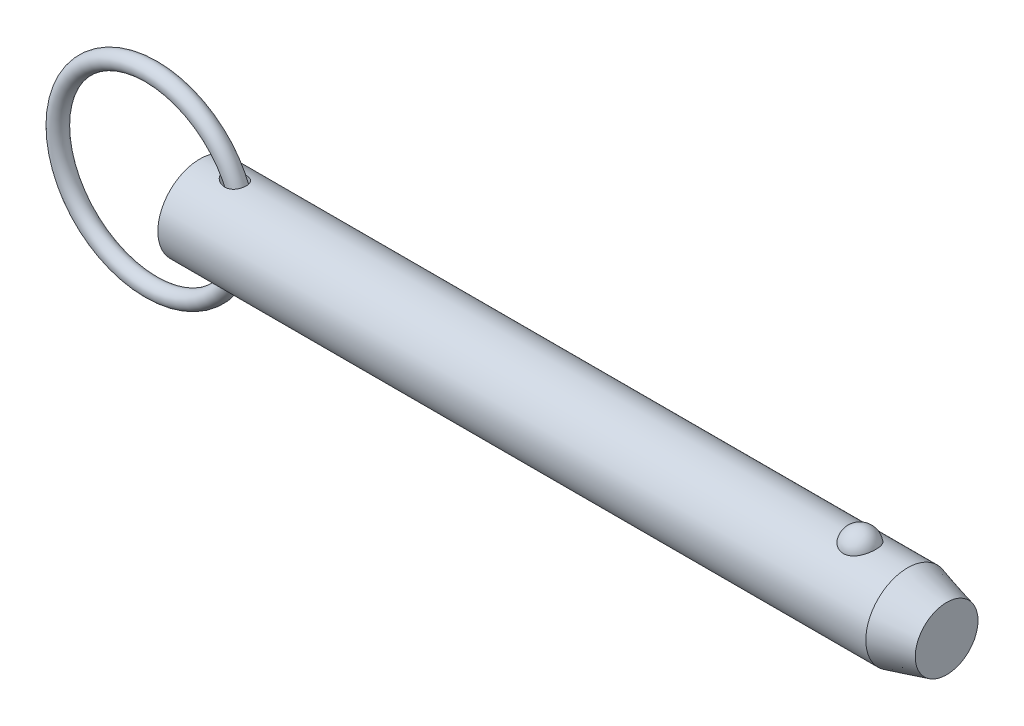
ISO-10303-21;
HEADER;
FILE_DESCRIPTION(('STEP AP214'),'2;1');
FILE_NAME('part.step','',(''),(''),'','','');
FILE_SCHEMA(('AUTOMOTIVE_DESIGN { 1 0 10303 214 1 1 1 1 }'));
ENDSEC;
DATA;
#1=APPLICATION_CONTEXT('core data for automotive mechanical design processes');
#2=APPLICATION_PROTOCOL_DEFINITION('international standard','automotive_design',2000,#1);
#3=PRODUCT_CONTEXT('',#1,'mechanical');
#4=PRODUCT('Part','Part','',(#3));
#5=PRODUCT_RELATED_PRODUCT_CATEGORY('part','',(#4));
#6=PRODUCT_DEFINITION_FORMATION('','',#4);
#7=PRODUCT_DEFINITION_CONTEXT('part definition',#1,'design');
#8=PRODUCT_DEFINITION('design','',#6,#7);
#9=PRODUCT_DEFINITION_SHAPE('','',#8);
#10=(LENGTH_UNIT() NAMED_UNIT(*) SI_UNIT(.MILLI.,.METRE.));
#11=(NAMED_UNIT(*) PLANE_ANGLE_UNIT() SI_UNIT($,.RADIAN.));
#12=(NAMED_UNIT(*) SI_UNIT($,.STERADIAN.) SOLID_ANGLE_UNIT());
#13=UNCERTAINTY_MEASURE_WITH_UNIT(LENGTH_MEASURE(1.E-05),#10,'distance_accuracy_value','');
#14=(GEOMETRIC_REPRESENTATION_CONTEXT(3) GLOBAL_UNCERTAINTY_ASSIGNED_CONTEXT((#13)) GLOBAL_UNIT_ASSIGNED_CONTEXT((#10,
#11,#12)) REPRESENTATION_CONTEXT('',''));
#15=CARTESIAN_POINT('',(0.,0.,0.));
#16=DIRECTION('',(0.,0.,1.));
#17=DIRECTION('',(1.,0.,0.));
#18=AXIS2_PLACEMENT_3D('',#15,#16,#17);
#19=CARTESIAN_POINT('',(-8.23730968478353,0.,0.));
#20=DIRECTION('',(0.,0.,1.));
#21=DIRECTION('',(1.,0.,0.));
#22=AXIS2_PLACEMENT_3D('',#19,#20,#21);
#23=TOROIDAL_SURFACE('',#22,15.875,1.422);
#24=CARTESIAN_POINT('',(9.05969031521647,0.,0.));
#25=VERTEX_POINT('',#24);
#26=VERTEX_LOOP('',#25);
#27=FACE_BOUND('',#26,.T.);
#28=ADVANCED_FACE('P0_F12',(#27),#23,.T.);
#29=CLOSED_SHELL('',(#28));
#30=MANIFOLD_SOLID_BREP('P0_B1',#29);
#31=CARTESIAN_POINT('',(0.,0.,0.));
#32=DIRECTION('',(1.,0.,0.));
#33=DIRECTION('',(0.,0.,-1.));
#34=AXIS2_PLACEMENT_3D('',#31,#32,#33);
#35=CYLINDRICAL_SURFACE('',#34,7.11);
#36=CARTESIAN_POINT('',(3.98467340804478,7.10072679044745,-0.363013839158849));
#37=CARTESIAN_POINT('',(4.00971652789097,7.09600153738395,-0.45539194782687));
#38=CARTESIAN_POINT('',(4.04401947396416,7.08958406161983,-0.545230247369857));
#39=CARTESIAN_POINT('',(4.12810160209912,7.07427055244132,-0.717157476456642));
#40=CARTESIAN_POINT('',(4.17791765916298,7.06536861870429,-0.799227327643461));
#41=CARTESIAN_POINT('',(4.28924471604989,7.04620300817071,-0.953469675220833));
#42=CARTESIAN_POINT('',(4.35063580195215,7.035953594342,-1.02573162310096));
#43=CARTESIAN_POINT('',(4.48282610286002,7.01493313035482,-1.16081412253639));
#44=CARTESIAN_POINT('',(4.55362244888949,7.00416223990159,-1.22363754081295));
#45=CARTESIAN_POINT('',(4.71659336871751,6.98090398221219,-1.35055080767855));
#46=CARTESIAN_POINT('',(4.81029272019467,6.96847103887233,-1.41269256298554));
#47=CARTESIAN_POINT('',(5.0057240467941,6.94515366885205,-1.52319699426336));
#48=CARTESIAN_POINT('',(5.10746392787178,6.93427079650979,-1.57154588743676));
#49=CARTESIAN_POINT('',(5.33503739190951,6.91346066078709,-1.66091325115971));
#50=CARTESIAN_POINT('',(5.46199550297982,6.90402388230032,-1.69921932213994));
#51=CARTESIAN_POINT('',(5.72084799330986,6.89024030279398,-1.75428261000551));
#52=CARTESIAN_POINT('',(5.85274301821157,6.88589416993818,-1.77103699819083));
#53=CARTESIAN_POINT('',(6.11557710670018,6.88337277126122,-1.78081990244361));
#54=CARTESIAN_POINT('',(6.24650031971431,6.88510489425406,-1.77420448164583));
#55=CARTESIAN_POINT('',(6.50446311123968,6.89478744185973,-1.73620392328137));
#56=CARTESIAN_POINT('',(6.6315075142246,6.90272978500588,-1.70485097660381));
#57=CARTESIAN_POINT('',(6.85933269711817,6.92243075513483,-1.62281888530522));
#58=CARTESIAN_POINT('',(6.96133251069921,6.93352131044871,-1.5753580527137));
#59=CARTESIAN_POINT('',(7.15436649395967,6.95824811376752,-1.46226310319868));
#60=CARTESIAN_POINT('',(7.24540699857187,6.97188287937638,-1.3966395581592));
#61=CARTESIAN_POINT('',(7.40446019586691,6.99838217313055,-1.25668991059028));
#62=CARTESIAN_POINT('',(7.473875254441,7.01118308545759,-1.18393777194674));
#63=CARTESIAN_POINT('',(7.59904891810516,7.03582803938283,-1.02736918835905));
#64=CARTESIAN_POINT('',(7.65481029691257,7.04767227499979,-0.943554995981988));
#65=CARTESIAN_POINT('',(7.74982438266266,7.06873077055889,-0.76979592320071));
#66=CARTESIAN_POINT('',(7.7894903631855,7.07800861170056,-0.680084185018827));
#67=CARTESIAN_POINT('',(7.85354088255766,7.09334756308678,-0.495102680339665));
#68=CARTESIAN_POINT('',(7.87792559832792,7.09940871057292,-0.399832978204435));
#69=CARTESIAN_POINT('',(7.9108898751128,7.10766731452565,-0.206294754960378));
#70=CARTESIAN_POINT('',(7.91944662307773,7.10985919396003,-0.108022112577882));
#71=CARTESIAN_POINT('',(7.920501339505,7.11012756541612,0.0886168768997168));
#72=CARTESIAN_POINT('',(7.91299895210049,7.10820396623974,0.186983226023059));
#73=CARTESIAN_POINT('',(7.88205794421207,7.10043733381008,0.381270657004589));
#74=CARTESIAN_POINT('',(7.85857985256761,7.09458459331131,0.477185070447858));
#75=CARTESIAN_POINT('',(7.79617406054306,7.07958431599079,0.663575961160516));
#76=CARTESIAN_POINT('',(7.75724672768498,7.07043685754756,0.754052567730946));
#77=CARTESIAN_POINT('',(7.66496731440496,7.04987259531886,0.926798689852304));
#78=CARTESIAN_POINT('',(7.61164530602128,7.0384605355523,1.00908483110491));
#79=CARTESIAN_POINT('',(7.49191707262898,7.01461776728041,1.16333092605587));
#80=CARTESIAN_POINT('',(7.42551210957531,7.00218715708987,1.235291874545));
#81=CARTESIAN_POINT('',(7.28164031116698,6.97770944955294,1.36680167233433));
#82=CARTESIAN_POINT('',(7.20420170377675,6.96566146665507,1.42638126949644));
#83=CARTESIAN_POINT('',(7.0403906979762,6.94319963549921,1.53199377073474));
#84=CARTESIAN_POINT('',(6.95401827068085,6.93278579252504,1.57802663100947));
#85=CARTESIAN_POINT('',(6.7731858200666,6.91444459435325,1.65656940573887));
#86=CARTESIAN_POINT('',(6.67860569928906,6.90656682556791,1.68881327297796));
#87=CARTESIAN_POINT('',(6.48544119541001,6.89422806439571,1.73849768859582));
#88=CARTESIAN_POINT('',(6.38685561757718,6.88976809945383,1.755933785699));
#89=CARTESIAN_POINT('',(6.18089829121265,6.88429907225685,1.77726234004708));
#90=CARTESIAN_POINT('',(6.07340937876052,6.88356485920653,1.78007646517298));
#91=CARTESIAN_POINT('',(5.85921220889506,6.886086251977,1.77029087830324));
#92=CARTESIAN_POINT('',(5.75250426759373,6.88934339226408,1.75768523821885));
#93=CARTESIAN_POINT('',(5.52848027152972,6.89994454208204,1.71563399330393));
#94=CARTESIAN_POINT('',(5.41155168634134,6.90775772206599,1.68424184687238));
#95=CARTESIAN_POINT('',(5.18376466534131,6.92670168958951,1.60454711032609));
#96=CARTESIAN_POINT('',(5.07291446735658,6.9378368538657,1.5562221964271));
#97=CARTESIAN_POINT('',(4.84835244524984,6.96347168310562,1.43744827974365));
#98=CARTESIAN_POINT('',(4.73562531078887,6.97820486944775,1.36517310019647));
#99=CARTESIAN_POINT('',(4.52504912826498,7.00822340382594,1.20158053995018));
#100=CARTESIAN_POINT('',(4.42717478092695,7.02350775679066,1.11029618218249));
#101=CARTESIAN_POINT('',(4.27935716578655,7.04784659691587,0.940654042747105));
#102=CARTESIAN_POINT('',(4.2239722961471,7.05736064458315,0.867099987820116));
#103=CARTESIAN_POINT('',(4.12558347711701,7.07469854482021,0.711919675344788));
#104=CARTESIAN_POINT('',(4.08256922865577,7.0825238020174,0.630300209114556));
#105=CARTESIAN_POINT('',(4.01142860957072,7.09565978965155,0.459428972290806));
#106=CARTESIAN_POINT('',(3.98346043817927,7.10094374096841,0.370107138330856));
#107=CARTESIAN_POINT('',(3.95517285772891,7.1063173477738,0.233358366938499));
#108=CARTESIAN_POINT('',(3.94802115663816,7.1076831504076,0.187321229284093));
#109=CARTESIAN_POINT('',(3.93842121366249,7.10951900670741,0.0947476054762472));
#110=CARTESIAN_POINT('',(3.93597129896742,7.10998937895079,0.0482113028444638));
#111=CARTESIAN_POINT('',(3.93584361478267,7.11001358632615,-0.0598597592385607));
#112=CARTESIAN_POINT('',(3.9399538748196,7.10922402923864,-0.121405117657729));
#113=CARTESIAN_POINT('',(3.95632793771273,7.10609781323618,-0.243320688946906));
#114=CARTESIAN_POINT('',(3.96859135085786,7.10376122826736,-0.303690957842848));
#115=CARTESIAN_POINT('',(3.98467340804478,7.10072679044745,-0.363013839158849));
#116=B_SPLINE_CURVE_WITH_KNOTS('',3,(#36,#37,#38,#39,#40,#41,#42,#43,#44,#45,#46,#47,#48,#49,
#50,#51,#52,#53,#54,#55,#56,#57,#58,#59,#60,#61,#62,#63,#64,#65,#66,#67,#68,#69,#70,#71,#72,#73,
#74,#75,#76,#77,#78,#79,#80,#81,#82,#83,#84,#85,#86,#87,#88,#89,#90,#91,#92,#93,#94,#95,#96,#97,
#98,#99,#100,#101,#102,#103,#104,#105,#106,#107,#108,#109,#110,#111,#112,#113,#114,#115),
.UNSPECIFIED.,.T.,.F.,(4,2,2,2,2,2,2,2,2,2,2,2,2,2,2,2,2,2,2,2,2,2,2,2,2,2,2,2,2,2,2,2,2,2,2,2,
2,2,2,4),(0.,0.287206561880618,0.575101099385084,0.860162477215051,1.14513709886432,
1.48324846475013,1.82169652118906,2.21865672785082,2.6156690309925,3.00665870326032,
3.39714041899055,3.73437585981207,4.07141541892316,4.37402271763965,4.67656849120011,
4.97076150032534,5.26495110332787,5.55956439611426,5.85418421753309,6.14953461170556,
6.44487798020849,6.73960905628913,7.03431171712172,7.32827352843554,7.6222362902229,
7.9216396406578,8.22113296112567,8.54242840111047,8.86384740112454,9.22635035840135,
9.58933304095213,9.99153142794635,10.3930368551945,10.6697219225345,10.9461759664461,
11.2254825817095,11.3650959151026,11.5046595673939,11.6891051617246,11.8735419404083),.UNSPECIFIED.);
#117=CARTESIAN_POINT('',(3.98467340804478,7.10072679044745,-0.363013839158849));
#118=VERTEX_POINT('',#117);
#119=EDGE_CURVE('P1_E40',#118,#118,#116,.T.);
#120=ORIENTED_EDGE('',*,*,#119,.T.);
#121=EDGE_LOOP('',(#120));
#122=FACE_BOUND('',#121,.T.);
#123=CARTESIAN_POINT('',(120.336279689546,0.,0.));
#124=DIRECTION('',(1.,0.,0.));
#125=DIRECTION('',(0.,0.,-1.));
#126=AXIS2_PLACEMENT_3D('',#123,#124,#125);
#127=CIRCLE('',#126,7.11);
#128=CARTESIAN_POINT('',(120.336279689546,0.,-7.11));
#129=VERTEX_POINT('',#128);
#130=EDGE_CURVE('P1_E25',#129,#129,#127,.T.);
#131=ORIENTED_EDGE('',*,*,#130,.F.);
#132=EDGE_LOOP('',(#131));
#133=FACE_BOUND('',#132,.T.);
#134=CARTESIAN_POINT('',(0.,0.,0.));
#135=DIRECTION('',(1.,0.,0.));
#136=DIRECTION('',(0.,0.,-1.));
#137=AXIS2_PLACEMENT_3D('',#134,#135,#136);
#138=CIRCLE('',#137,7.11);
#139=CARTESIAN_POINT('',(0.,0.,-7.11));
#140=VERTEX_POINT('',#139);
#141=EDGE_CURVE('P1_E9',#140,#140,#138,.T.);
#142=ORIENTED_EDGE('',*,*,#141,.T.);
#143=EDGE_LOOP('',(#142));
#144=FACE_BOUND('',#143,.T.);
#145=CARTESIAN_POINT('',(112.229258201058,6.53646663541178,2.79762469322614));
#146=CARTESIAN_POINT('',(112.084429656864,6.53647876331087,2.79761243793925));
#147=CARTESIAN_POINT('',(111.939368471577,6.54144531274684,2.78608115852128));
#148=CARTESIAN_POINT('',(111.653292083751,6.56077791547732,2.74023282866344));
#149=CARTESIAN_POINT('',(111.512288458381,6.57516852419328,2.70585624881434));
#150=CARTESIAN_POINT('',(111.23888335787,6.61165072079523,2.6154404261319));
#151=CARTESIAN_POINT('',(111.106460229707,6.63372195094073,2.55945840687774));
#152=CARTESIAN_POINT('',(110.853233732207,6.68316012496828,2.42742958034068));
#153=CARTESIAN_POINT('',(110.732425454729,6.71052481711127,2.35139129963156));
#154=CARTESIAN_POINT('',(110.501637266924,6.76860821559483,2.17866150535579));
#155=CARTESIAN_POINT('',(110.392085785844,6.79940242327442,2.08142342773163));
#156=CARTESIAN_POINT('',(110.19033404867,6.86050242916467,1.87020907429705));
#157=CARTESIAN_POINT('',(110.098139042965,6.89080807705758,1.75622775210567));
#158=CARTESIAN_POINT('',(109.92925478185,6.94923069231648,1.50900646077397));
#159=CARTESIAN_POINT('',(109.853428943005,6.97719213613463,1.37513873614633));
#160=CARTESIAN_POINT('',(109.724206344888,7.02647251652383,1.09584817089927));
#161=CARTESIAN_POINT('',(109.670810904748,7.04779106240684,0.950424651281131));
#162=CARTESIAN_POINT('',(109.587101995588,7.08180248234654,0.650508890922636));
#163=CARTESIAN_POINT('',(109.557025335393,7.09440672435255,0.495940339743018));
#164=CARTESIAN_POINT('',(109.521473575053,7.10935121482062,0.183515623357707));
#165=CARTESIAN_POINT('',(109.515997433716,7.11169189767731,0.0256595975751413));
#166=CARTESIAN_POINT('',(109.529700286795,7.10589702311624,-0.287512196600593));
#167=CARTESIAN_POINT('',(109.54868231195,7.0978451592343,-0.442838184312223));
#168=CARTESIAN_POINT('',(109.61057450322,7.07221860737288,-0.747830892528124));
#169=CARTESIAN_POINT('',(109.653485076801,7.05464375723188,-0.897497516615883));
#170=CARTESIAN_POINT('',(109.762452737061,7.01171031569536,-1.18722864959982));
#171=CARTESIAN_POINT('',(109.828545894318,6.98633960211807,-1.32727778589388));
#172=CARTESIAN_POINT('',(109.982536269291,6.93042258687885,-1.59370324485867));
#173=CARTESIAN_POINT('',(110.070435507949,6.89987580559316,-1.72007829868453));
#174=CARTESIAN_POINT('',(110.266926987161,6.83659510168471,-1.95657345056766));
#175=CARTESIAN_POINT('',(110.375664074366,6.80384697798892,-2.06656957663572));
#176=CARTESIAN_POINT('',(110.610968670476,6.74001831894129,-2.26611005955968));
#177=CARTESIAN_POINT('',(110.737535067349,6.7089376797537,-2.3556556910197));
#178=CARTESIAN_POINT('',(111.002845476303,6.65264442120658,-2.51019726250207));
#179=CARTESIAN_POINT('',(111.141323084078,6.62733449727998,-2.57561395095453));
#180=CARTESIAN_POINT('',(111.428519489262,6.58495995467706,-2.68211134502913));
#181=CARTESIAN_POINT('',(111.577234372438,6.56789220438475,-2.72320129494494));
#182=CARTESIAN_POINT('',(111.872626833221,6.54478663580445,-2.77825810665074));
#183=CARTESIAN_POINT('',(112.01902951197,6.53823639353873,-2.79348727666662));
#184=CARTESIAN_POINT('',(112.312470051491,6.5353271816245,-2.80028921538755));
#185=CARTESIAN_POINT('',(112.459507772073,6.53896606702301,-2.79186696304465));
#186=CARTESIAN_POINT('',(112.744921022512,6.55570357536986,-2.75232178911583));
#187=CARTESIAN_POINT('',(112.883422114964,6.56848455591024,-2.72196077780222));
#188=CARTESIAN_POINT('',(113.153114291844,6.60173528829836,-2.64028774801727));
#189=CARTESIAN_POINT('',(113.284304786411,6.62220565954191,-2.58897404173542));
#190=CARTESIAN_POINT('',(113.538846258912,6.66917927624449,-2.46547820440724));
#191=CARTESIAN_POINT('',(113.661969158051,6.69580233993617,-2.39287266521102));
#192=CARTESIAN_POINT('',(113.894441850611,6.75207041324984,-2.22915269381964));
#193=CARTESIAN_POINT('',(114.003788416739,6.78171612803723,-2.13803393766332));
#194=CARTESIAN_POINT('',(114.211642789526,6.8426462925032,-1.93445592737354));
#195=CARTESIAN_POINT('',(114.309317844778,6.87393748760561,-1.8211477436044));
#196=CARTESIAN_POINT('',(114.485011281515,6.93345710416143,-1.57947787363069));
#197=CARTESIAN_POINT('',(114.563026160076,6.96168497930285,-1.45111351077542));
#198=CARTESIAN_POINT('',(114.699985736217,7.01307558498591,-1.17842708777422));
#199=CARTESIAN_POINT('',(114.758258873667,7.03605262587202,-1.03373189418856));
#200=CARTESIAN_POINT('',(114.851081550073,7.07340932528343,-0.735867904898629));
#201=CARTESIAN_POINT('',(114.885631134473,7.08778900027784,-0.582699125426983));
#202=CARTESIAN_POINT('',(114.930274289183,7.10647639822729,-0.272420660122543));
#203=CARTESIAN_POINT('',(114.94039710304,7.11079616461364,-0.115315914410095));
#204=CARTESIAN_POINT('',(114.936061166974,7.10896059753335,0.198488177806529));
#205=CARTESIAN_POINT('',(114.921603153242,7.10280557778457,0.355187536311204));
#206=CARTESIAN_POINT('',(114.868572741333,7.08071500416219,0.662724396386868));
#207=CARTESIAN_POINT('',(114.83015058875,7.06484039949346,0.813592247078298));
#208=CARTESIAN_POINT('',(114.730101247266,7.0249589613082,1.10629159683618));
#209=CARTESIAN_POINT('',(114.668472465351,7.00095156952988,1.24812247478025));
#210=CARTESIAN_POINT('',(114.522766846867,6.94706632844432,1.51976439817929));
#211=CARTESIAN_POINT('',(114.438544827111,6.91715085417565,1.64949012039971));
#212=CARTESIAN_POINT('',(114.249586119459,6.85470565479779,1.8923128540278));
#213=CARTESIAN_POINT('',(114.144850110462,6.82217601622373,2.00541041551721));
#214=CARTESIAN_POINT('',(113.917103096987,6.75805358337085,2.21190674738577));
#215=CARTESIAN_POINT('',(113.794082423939,6.72646129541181,2.30529503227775));
#216=CARTESIAN_POINT('',(113.53273470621,6.66789520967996,2.46959908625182));
#217=CARTESIAN_POINT('',(113.394401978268,6.64092313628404,2.54050647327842));
#218=CARTESIAN_POINT('',(113.111182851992,6.59572583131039,2.6556004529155));
#219=CARTESIAN_POINT('',(112.966666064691,6.57724013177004,2.70059539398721));
#220=CARTESIAN_POINT('',(112.671546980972,6.55006426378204,2.76587321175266));
#221=CARTESIAN_POINT('',(112.520964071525,6.54134511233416,2.78622922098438));
#222=CARTESIAN_POINT('',(112.323046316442,6.53697847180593,2.79642434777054));
#223=CARTESIAN_POINT('',(112.276164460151,6.53646270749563,2.79762866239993));
#224=CARTESIAN_POINT('',(112.229258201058,6.53646663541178,2.79762469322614));
#225=B_SPLINE_CURVE_WITH_KNOTS('',3,(#145,#146,#147,#148,#149,#150,#151,#152,#153,#154,#155,
#156,#157,#158,#159,#160,#161,#162,#163,#164,#165,#166,#167,#168,#169,#170,#171,#172,#173,#174,
#175,#176,#177,#178,#179,#180,#181,#182,#183,#184,#185,#186,#187,#188,#189,#190,#191,#192,#193,
#194,#195,#196,#197,#198,#199,#200,#201,#202,#203,#204,#205,#206,#207,#208,#209,#210,#211,#212,
#213,#214,#215,#216,#217,#218,#219,#220,#221,#222,#223,#224),.UNSPECIFIED.,.T.,.F.,(4,2,2,2,2,2,
2,2,2,2,2,2,2,2,2,2,2,2,2,2,2,2,2,2,2,2,2,2,2,2,2,2,2,2,2,2,2,2,2,4),(0.,0.434355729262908,
0.869847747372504,1.30419416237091,1.738356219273,2.18541922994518,2.63261726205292,
3.0995426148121,3.56649542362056,4.0381303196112,4.50974525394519,4.97758575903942,
5.44543423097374,5.91401389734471,6.38263700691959,6.85464418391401,7.32662193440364,
7.78992971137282,8.25306131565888,8.69285754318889,9.13256119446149,9.55768625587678,
9.98284556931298,10.4171106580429,10.851477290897,11.3079089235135,11.7644218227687,
12.2351898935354,12.7059570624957,13.1761603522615,13.6463495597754,14.1136200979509,
14.5809227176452,15.0513032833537,15.5216682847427,15.9922828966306,16.4630727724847,
16.9182457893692,17.3720644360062,17.5127411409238),.UNSPECIFIED.);
#226=CARTESIAN_POINT('',(112.229258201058,6.53646663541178,2.79762469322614));
#227=VERTEX_POINT('',#226);
#228=EDGE_CURVE('P1_E34',#227,#227,#225,.T.);
#229=ORIENTED_EDGE('',*,*,#228,.T.);
#230=EDGE_LOOP('',(#229));
#231=FACE_BOUND('',#230,.T.);
#232=CARTESIAN_POINT('',(3.98467340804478,-7.10072679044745,-0.363013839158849));
#233=CARTESIAN_POINT('',(3.96426456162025,-7.10457733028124,-0.287714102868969));
#234=CARTESIAN_POINT('',(3.95000501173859,-7.10730349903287,-0.210695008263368));
#235=CARTESIAN_POINT('',(3.93481801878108,-7.11020840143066,-0.0553038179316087));
#236=CARTESIAN_POINT('',(3.93388435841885,-7.11038832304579,0.0230676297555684));
#237=CARTESIAN_POINT('',(3.94541910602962,-7.10817995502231,0.178714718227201));
#238=CARTESIAN_POINT('',(3.95787987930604,-7.10579312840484,0.25599095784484));
#239=CARTESIAN_POINT('',(3.99523775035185,-7.09872642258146,0.407352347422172));
#240=CARTESIAN_POINT('',(4.02014065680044,-7.09404547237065,0.481435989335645));
#241=CARTESIAN_POINT('',(4.08119600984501,-7.08278363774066,0.625775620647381));
#242=CARTESIAN_POINT('',(4.11749458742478,-7.07617815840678,0.695967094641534));
#243=CARTESIAN_POINT('',(4.19940836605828,-7.06165305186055,0.830508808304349));
#244=CARTESIAN_POINT('',(4.24502952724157,-7.0537325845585,0.894855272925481));
#245=CARTESIAN_POINT('',(4.36790232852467,-7.03310314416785,1.04688574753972));
#246=CARTESIAN_POINT('',(4.44977459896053,-7.01993229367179,1.13078695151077));
#247=CARTESIAN_POINT('',(4.62610796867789,-6.99351259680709,1.28411726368));
#248=CARTESIAN_POINT('',(4.7205898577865,-6.98026365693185,1.35352197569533));
#249=CARTESIAN_POINT('',(4.92036507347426,-6.9549104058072,1.47831921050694));
#250=CARTESIAN_POINT('',(5.02579054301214,-6.94282458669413,1.53350332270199));
#251=CARTESIAN_POINT('',(5.24378330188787,-6.92129098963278,1.62793610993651));
#252=CARTESIAN_POINT('',(5.35635066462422,-6.91184323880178,1.66718462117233));
#253=CARTESIAN_POINT('',(5.60134354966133,-6.89573491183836,1.73269893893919));
#254=CARTESIAN_POINT('',(5.73444697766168,-6.8895970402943,1.75661057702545));
#255=CARTESIAN_POINT('',(6.00300738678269,-6.88344616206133,1.78057487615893));
#256=CARTESIAN_POINT('',(6.13846360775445,-6.88343121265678,1.78063510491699));
#257=CARTESIAN_POINT('',(6.39660470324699,-6.88981379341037,1.75576480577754));
#258=CARTESIAN_POINT('',(6.51947843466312,-6.89572457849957,1.73273121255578));
#259=CARTESIAN_POINT('',(6.75813770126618,-6.91274434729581,1.66352936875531));
#260=CARTESIAN_POINT('',(6.87393155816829,-6.92384709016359,1.61738888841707));
#261=CARTESIAN_POINT('',(7.07801861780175,-6.94787316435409,1.51052664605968));
#262=CARTESIAN_POINT('',(7.16789841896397,-6.96033024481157,1.45271574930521));
#263=CARTESIAN_POINT('',(7.33546773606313,-6.98638661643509,1.32171912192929));
#264=CARTESIAN_POINT('',(7.41316182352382,-6.99998547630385,1.24853918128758));
#265=CARTESIAN_POINT('',(7.54861420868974,-7.02559503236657,1.09486170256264));
#266=CARTESIAN_POINT('',(7.60741145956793,-7.03764930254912,1.01528346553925));
#267=CARTESIAN_POINT('',(7.71070740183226,-7.0598657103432,0.847099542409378));
#268=CARTESIAN_POINT('',(7.75520788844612,-7.0700280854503,0.758494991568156));
#269=CARTESIAN_POINT('',(7.82836147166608,-7.08722075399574,0.575936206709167));
#270=CARTESIAN_POINT('',(7.85719783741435,-7.09428707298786,0.482058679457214));
#271=CARTESIAN_POINT('',(7.89918378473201,-7.10470260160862,0.29065874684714));
#272=CARTESIAN_POINT('',(7.91233308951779,-7.10805174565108,0.193136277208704));
#273=CARTESIAN_POINT('',(7.92267451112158,-7.11067890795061,-0.00313968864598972));
#274=CARTESIAN_POINT('',(7.91981203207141,-7.10994299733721,-0.10189624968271));
#275=CARTESIAN_POINT('',(7.89806489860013,-7.10444651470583,-0.297516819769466));
#276=CARTESIAN_POINT('',(7.87918005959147,-7.09968589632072,-0.394380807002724));
#277=CARTESIAN_POINT('',(7.82577988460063,-7.0866471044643,-0.58355375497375));
#278=CARTESIAN_POINT('',(7.79124976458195,-7.07836560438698,-0.675858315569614));
#279=CARTESIAN_POINT('',(7.70736343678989,-7.05919003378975,-0.853167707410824));
#280=CARTESIAN_POINT('',(7.65800801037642,-7.04829610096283,-0.938172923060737));
#281=CARTESIAN_POINT('',(7.54590141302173,-7.02513961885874,-1.09819812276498));
#282=CARTESIAN_POINT('',(7.48319521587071,-7.01288172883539,-1.17325029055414));
#283=CARTESIAN_POINT('',(7.34599775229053,-6.98832192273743,-1.31164333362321));
#284=CARTESIAN_POINT('',(7.27150757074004,-6.97602001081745,-1.37498528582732));
#285=CARTESIAN_POINT('',(7.11277776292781,-6.95268608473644,-1.48849974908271));
#286=CARTESIAN_POINT('',(7.02852525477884,-6.94165578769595,-1.53865456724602));
#287=CARTESIAN_POINT('',(6.85282430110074,-6.92200320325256,-1.62478650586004));
#288=CARTESIAN_POINT('',(6.76137511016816,-6.91338116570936,-1.66076215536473));
#289=CARTESIAN_POINT('',(6.57061179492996,-6.89906044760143,-1.71930563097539));
#290=CARTESIAN_POINT('',(6.47113516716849,-6.89347290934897,-1.74136795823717));
#291=CARTESIAN_POINT('',(6.26989833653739,-6.88605020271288,-1.7704895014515));
#292=CARTESIAN_POINT('',(6.16813737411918,-6.88421630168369,-1.77754365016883));
#293=CARTESIAN_POINT('',(5.95492537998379,-6.88424071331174,-1.77745174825));
#294=CARTESIAN_POINT('',(5.8434768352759,-6.88646827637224,-1.76888555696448));
#295=CARTESIAN_POINT('',(5.62307560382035,-6.89483827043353,-1.73596677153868));
#296=CARTESIAN_POINT('',(5.51412477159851,-6.90098351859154,-1.71160281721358));
#297=CARTESIAN_POINT('',(5.28644478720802,-6.91743803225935,-1.64393691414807));
#298=CARTESIAN_POINT('',(5.16837217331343,-6.92819628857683,-1.59852806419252));
#299=CARTESIAN_POINT('',(4.94091825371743,-6.95234836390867,-1.4899796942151));
#300=CARTESIAN_POINT('',(4.83153887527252,-6.96574276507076,-1.42683625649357));
#301=CARTESIAN_POINT('',(4.63576710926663,-6.99209234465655,-1.29112257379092));
#302=CARTESIAN_POINT('',(4.54816728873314,-7.00494184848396,-1.22027748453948));
#303=CARTESIAN_POINT('',(4.38554897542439,-7.03019055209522,-1.0652111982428));
#304=CARTESIAN_POINT('',(4.31052141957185,-7.04259007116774,-0.980999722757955));
#305=CARTESIAN_POINT('',(4.18551811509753,-7.0640229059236,-0.811206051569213));
#306=CARTESIAN_POINT('',(4.13358417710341,-7.07328321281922,-0.727107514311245));
#307=CARTESIAN_POINT('',(4.04607461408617,-7.0891994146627,-0.550580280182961));
#308=CARTESIAN_POINT('',(4.01046401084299,-7.09586087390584,-0.458169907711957));
#309=CARTESIAN_POINT('',(3.98467340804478,-7.10072679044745,-0.363013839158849));
#310=B_SPLINE_CURVE_WITH_KNOTS('',3,(#232,#233,#234,#235,#236,#237,#238,#239,#240,#241,#242,
#243,#244,#245,#246,#247,#248,#249,#250,#251,#252,#253,#254,#255,#256,#257,#258,#259,#260,#261,
#262,#263,#264,#265,#266,#267,#268,#269,#270,#271,#272,#273,#274,#275,#276,#277,#278,#279,#280,
#281,#282,#283,#284,#285,#286,#287,#288,#289,#290,#291,#292,#293,#294,#295,#296,#297,#298,#299,
#300,#301,#302,#303,#304,#305,#306,#307,#308,#309),.UNSPECIFIED.,.T.,.F.,(4,2,2,2,2,2,2,2,2,2,2,
2,2,2,2,2,2,2,2,2,2,2,2,2,2,2,2,2,2,2,2,2,2,2,2,2,2,2,4),(0.,0.23402065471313,0.467932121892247,
0.701710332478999,0.935597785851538,1.17261620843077,1.40978663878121,1.76177576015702,
2.11435255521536,2.47183528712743,2.8293216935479,3.23332937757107,3.63720887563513,
4.01042610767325,4.38319587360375,4.70425151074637,5.02518641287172,5.32277979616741,
5.62033579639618,5.91433101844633,6.2083314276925,6.50333490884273,6.79834178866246,
7.09362801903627,7.38889868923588,7.6831900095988,7.9774542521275,8.27211131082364,
8.56679892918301,8.8716552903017,9.17661456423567,9.51069129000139,9.84500851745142,
10.2243046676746,10.6036846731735,10.9425776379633,11.2812252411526,11.5775945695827,
11.8733258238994),.UNSPECIFIED.);
#311=CARTESIAN_POINT('',(3.98467340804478,-7.10072679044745,-0.363013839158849));
#312=VERTEX_POINT('',#311);
#313=EDGE_CURVE('P1_E17',#312,#312,#310,.T.);
#314=ORIENTED_EDGE('',*,*,#313,.T.);
#315=EDGE_LOOP('',(#314));
#316=FACE_BOUND('',#315,.T.);
#317=ADVANCED_FACE('P1_F13',(#122,#133,#144,#231,#316),#35,.T.);
#318=CARTESIAN_POINT('',(0.,0.,0.));
#319=DIRECTION('',(-1.,0.,0.));
#320=DIRECTION('',(0.,0.,1.));
#321=AXIS2_PLACEMENT_3D('',#318,#319,#320);
#322=PLANE('',#321);
#323=ORIENTED_EDGE('',*,*,#141,.F.);
#324=EDGE_LOOP('',(#323));
#325=FACE_BOUND('',#324,.T.);
#326=ADVANCED_FACE('P1_F15',(#325),#322,.T.);
#327=CARTESIAN_POINT('',(126.97,0.,0.));
#328=DIRECTION('',(-1.,0.,0.));
#329=DIRECTION('',(0.,0.,1.));
#330=AXIS2_PLACEMENT_3D('',#327,#328,#329);
#331=CONICAL_SURFACE('',#330,5.33250000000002,0.26179938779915);
#332=ORIENTED_EDGE('',*,*,#130,.T.);
#333=EDGE_LOOP('',(#332));
#334=FACE_BOUND('',#333,.T.);
#335=CARTESIAN_POINT('',(126.97,0.,0.));
#336=DIRECTION('',(1.,0.,0.));
#337=DIRECTION('',(0.,0.,-1.));
#338=AXIS2_PLACEMENT_3D('',#335,#336,#337);
#339=CIRCLE('',#338,5.33250000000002);
#340=CARTESIAN_POINT('',(126.97,0.,-5.33250000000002));
#341=VERTEX_POINT('',#340);
#342=EDGE_CURVE('P1_E30',#341,#341,#339,.T.);
#343=ORIENTED_EDGE('',*,*,#342,.F.);
#344=EDGE_LOOP('',(#343));
#345=FACE_BOUND('',#344,.T.);
#346=ADVANCED_FACE('P1_F55',(#334,#345),#331,.T.);
#347=CARTESIAN_POINT('',(126.97,5.33250000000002,0.));
#348=DIRECTION('',(1.,0.,0.));
#349=DIRECTION('',(0.,0.,-1.));
#350=AXIS2_PLACEMENT_3D('',#347,#348,#349);
#351=PLANE('',#350);
#352=ORIENTED_EDGE('',*,*,#342,.T.);
#353=EDGE_LOOP('',(#352));
#354=FACE_BOUND('',#353,.T.);
#355=ADVANCED_FACE('P1_F51',(#354),#351,.T.);
#356=CARTESIAN_POINT('',(112.229258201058,6.399,0.));
#357=DIRECTION('',(-1.,0.,0.));
#358=DIRECTION('',(0.,-1.,0.));
#359=AXIS2_PLACEMENT_3D('',#356,#357,#358);
#360=SPHERICAL_SURFACE('',#359,2.80100000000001);
#361=ORIENTED_EDGE('',*,*,#228,.F.);
#362=EDGE_LOOP('',(#361));
#363=FACE_BOUND('',#362,.T.);
#364=ADVANCED_FACE('P1_F46',(#363),#360,.T.);
#365=CARTESIAN_POINT('',(-8.23730968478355,0.,0.));
#366=DIRECTION('',(0.,0.,1.));
#367=DIRECTION('',(1.,0.,0.));
#368=AXIS2_PLACEMENT_3D('',#365,#366,#367);
#369=TOROIDAL_SURFACE('',#368,15.875,1.7775);
#370=ORIENTED_EDGE('',*,*,#313,.F.);
#371=EDGE_LOOP('',(#370));
#372=FACE_BOUND('',#371,.T.);
#373=ORIENTED_EDGE('',*,*,#119,.F.);
#374=EDGE_LOOP('',(#373));
#375=FACE_BOUND('',#374,.T.);
#376=ADVANCED_FACE('P1_F50',(#372,#375),#369,.F.);
#377=CLOSED_SHELL('',(#317,#326,#346,#355,#364,#376));
#378=MANIFOLD_SOLID_BREP('P1_B1',#377);
#379=ADVANCED_BREP_SHAPE_REPRESENTATION('',(#18,#30,#378),#14);
#380=SHAPE_DEFINITION_REPRESENTATION(#9,#379);
ENDSEC;
END-ISO-10303-21;
